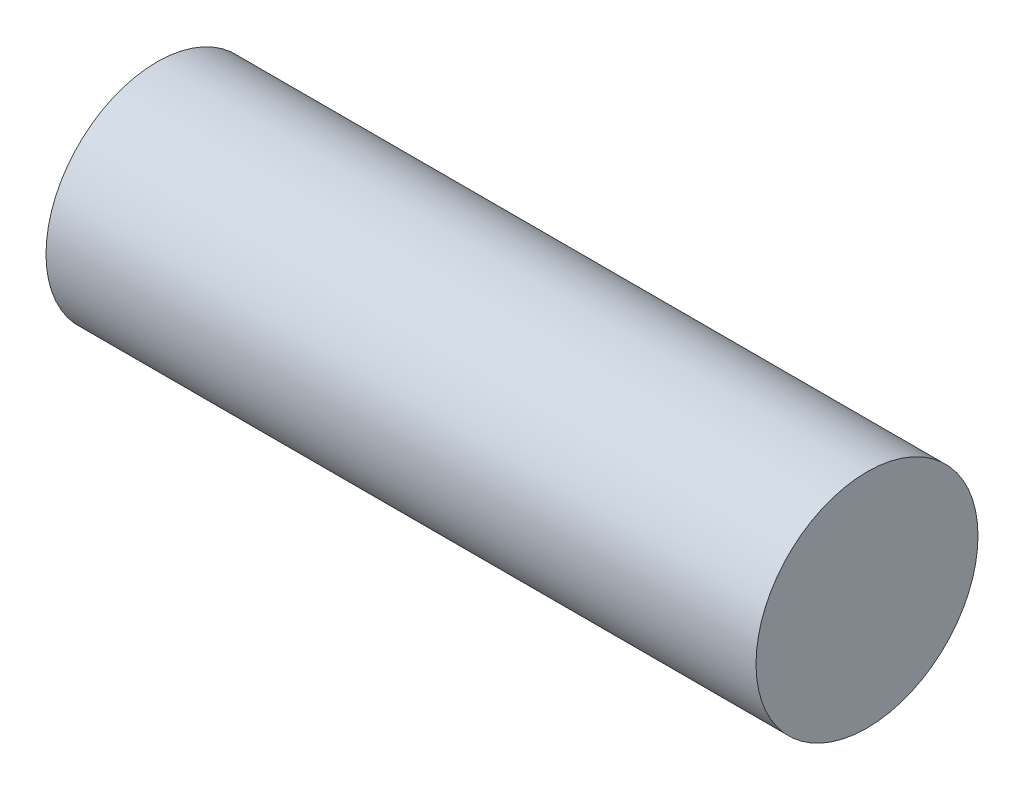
from build123d import *

# Parameters (mm, degrees)
SKETCH2_R           = 3
BOSS_EXTRUDE1_DEPTH = 19.19


with BuildPart() as part:
    # Sketch2 → Boss-Extrude1 (new body)
    with BuildSketch(Plane(origin=(0, 0, 0), x_dir=(0, 0, -1), z_dir=(1, 0, 0))):
        Circle(SKETCH2_R)
    extrude(amount=BOSS_EXTRUDE1_DEPTH)


solid = part.part
